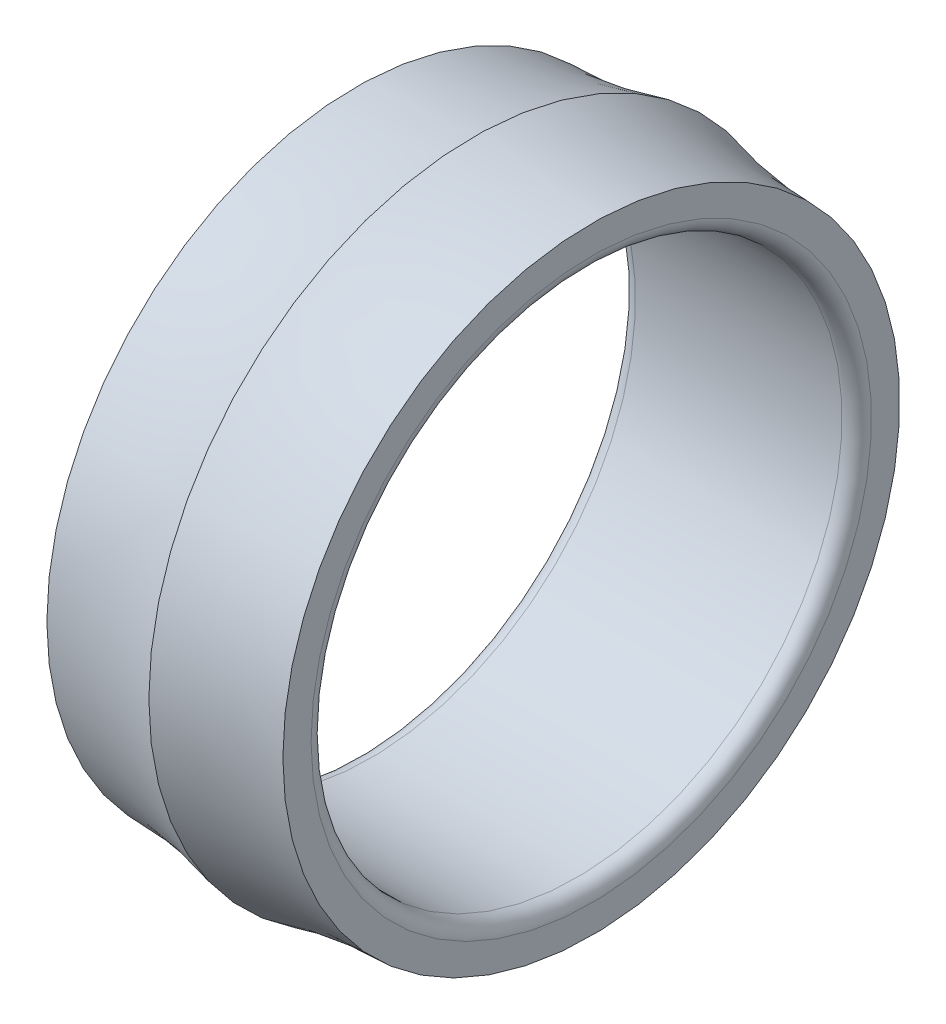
from build123d import *


with BuildPart() as part:
    # Esquisse1 → Base-R_volution (revolve)
    with BuildSketch(Plane(origin=(0, 0, 0), x_dir=(1, 0, 0), z_dir=(0, 1, 0)), mode=Mode.PRIVATE) as base_r_volution_sk:
        with BuildLine():
            Line((0, 47.5), (0, 52.284161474))
            ThreePointArc((0, 52.284161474), (10.091776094, 52.966222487), (20, 55))
            ThreePointArc((20, 55), (29.908223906, 52.966222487), (40, 52.284161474))
            Line((40, 52.284161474), (40, 47.5))
            ThreePointArc((40, 47.5), (39.267766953, 45.732233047), (37.5, 45))
            Line((37.5, 45), (2.5, 45))
            ThreePointArc((2.5, 45), (0.732233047, 45.732233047), (0, 47.5))
        make_face()
    revolve(base_r_volution_sk.sketch.rotate(Axis((0, 0, 0), (1, 0, 0)), 180), axis=Axis((0, 0, 0), (1, 0, 0)))


solid = part.part
